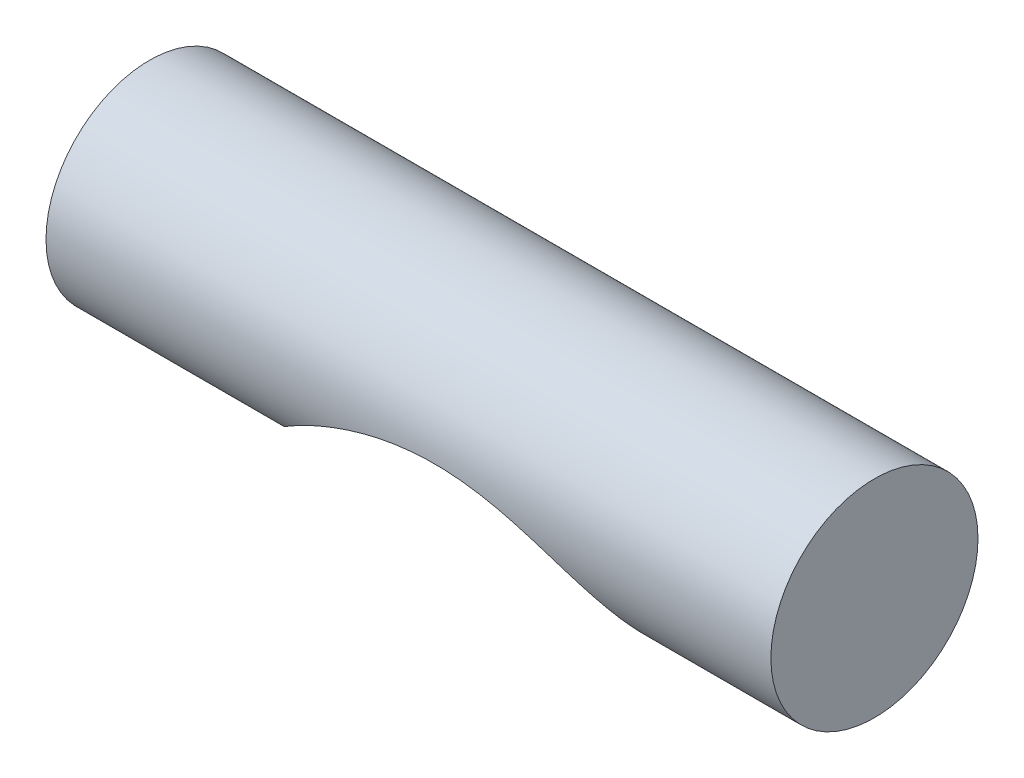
ISO-10303-21;
HEADER;
FILE_DESCRIPTION(('STEP AP214'),'2;1');
FILE_NAME('part.step','',(''),(''),'','','');
FILE_SCHEMA(('AUTOMOTIVE_DESIGN { 1 0 10303 214 1 1 1 1 }'));
ENDSEC;
DATA;
#1=APPLICATION_CONTEXT('core data for automotive mechanical design processes');
#2=APPLICATION_PROTOCOL_DEFINITION('international standard','automotive_design',2000,#1);
#3=PRODUCT_CONTEXT('',#1,'mechanical');
#4=PRODUCT('Part','Part','',(#3));
#5=PRODUCT_RELATED_PRODUCT_CATEGORY('part','',(#4));
#6=PRODUCT_DEFINITION_FORMATION('','',#4);
#7=PRODUCT_DEFINITION_CONTEXT('part definition',#1,'design');
#8=PRODUCT_DEFINITION('design','',#6,#7);
#9=PRODUCT_DEFINITION_SHAPE('','',#8);
#10=(LENGTH_UNIT() NAMED_UNIT(*) SI_UNIT(.MILLI.,.METRE.));
#11=(NAMED_UNIT(*) PLANE_ANGLE_UNIT() SI_UNIT($,.RADIAN.));
#12=(NAMED_UNIT(*) SI_UNIT($,.STERADIAN.) SOLID_ANGLE_UNIT());
#13=UNCERTAINTY_MEASURE_WITH_UNIT(LENGTH_MEASURE(1.E-05),#10,'distance_accuracy_value','');
#14=(GEOMETRIC_REPRESENTATION_CONTEXT(3) GLOBAL_UNCERTAINTY_ASSIGNED_CONTEXT((#13)) GLOBAL_UNIT_ASSIGNED_CONTEXT((#10,
#11,#12)) REPRESENTATION_CONTEXT('',''));
#15=CARTESIAN_POINT('',(0.,0.,0.));
#16=DIRECTION('',(0.,0.,1.));
#17=DIRECTION('',(1.,0.,0.));
#18=AXIS2_PLACEMENT_3D('',#15,#16,#17);
#19=CARTESIAN_POINT('',(-12.978154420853,1.5,-1.5));
#20=DIRECTION('',(-1.,0.,0.));
#21=DIRECTION('',(0.,-1.,0.));
#22=AXIS2_PLACEMENT_3D('',#19,#20,#21);
#23=PLANE('',#22);
#24=CARTESIAN_POINT('',(-12.978154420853,0.,0.));
#25=DIRECTION('',(-1.,0.,0.));
#26=DIRECTION('',(0.,0.,1.));
#27=AXIS2_PLACEMENT_3D('',#24,#25,#26);
#28=CIRCLE('',#27,2.);
#29=CARTESIAN_POINT('',(-12.978154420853,0.,2.));
#30=VERTEX_POINT('',#29);
#31=EDGE_CURVE('E8',#30,#30,#28,.F.);
#32=ORIENTED_EDGE('',*,*,#31,.F.);
#33=EDGE_LOOP('',(#32));
#34=FACE_BOUND('',#33,.T.);
#35=ADVANCED_FACE('F10',(#34),#23,.T.);
#36=CARTESIAN_POINT('',(-5.4781544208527,-5.,-2.));
#37=DIRECTION('',(0.,0.,1.));
#38=DIRECTION('',(1.,0.,0.));
#39=AXIS2_PLACEMENT_3D('',#36,#37,#38);
#40=CYLINDRICAL_SURFACE('',#39,5.00000000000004);
#41=CARTESIAN_POINT('',(-9.46526434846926,-1.98288972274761,-0.261052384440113));
#42=CARTESIAN_POINT('',(-9.45658740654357,-1.97142369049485,-0.348145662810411));
#43=CARTESIAN_POINT('',(-9.44353137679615,-1.95424935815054,-0.43404817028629));
#44=CARTESIAN_POINT('',(-9.40835615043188,-1.90898950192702,-0.602961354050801));
#45=CARTESIAN_POINT('',(-9.38605463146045,-1.88068510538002,-0.685875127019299));
#46=CARTESIAN_POINT('',(-9.33167847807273,-1.81373842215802,-0.847501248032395));
#47=CARTESIAN_POINT('',(-9.2993035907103,-1.77478374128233,-0.925982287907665));
#48=CARTESIAN_POINT('',(-9.2237227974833,-1.68726614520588,-1.07757151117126));
#49=CARTESIAN_POINT('',(-9.18007149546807,-1.63833171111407,-1.15024081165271));
#50=CARTESIAN_POINT('',(-9.08045380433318,-1.53170183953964,-1.28920975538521));
#51=CARTESIAN_POINT('',(-9.02386826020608,-1.47364257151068,-1.35478091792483));
#52=CARTESIAN_POINT('',(-8.89628814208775,-1.34966744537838,-1.47876362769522));
#53=CARTESIAN_POINT('',(-8.82447240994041,-1.28350555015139,-1.53607255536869));
#54=CARTESIAN_POINT('',(-8.66334360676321,-1.14420677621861,-1.64296833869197));
#55=CARTESIAN_POINT('',(-8.57297295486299,-1.07111194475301,-1.69098905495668));
#56=CARTESIAN_POINT('',(-8.36966578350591,-0.918635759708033,-1.77903248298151));
#57=CARTESIAN_POINT('',(-8.25535430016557,-0.839867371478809,-1.81690398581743));
#58=CARTESIAN_POINT('',(-8.06569598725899,-0.720781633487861,-1.8662244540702));
#59=CARTESIAN_POINT('',(-7.99313447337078,-0.677724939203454,-1.8821769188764));
#60=CARTESIAN_POINT('',(-7.84531325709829,-0.595034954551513,-1.90993097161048));
#61=CARTESIAN_POINT('',(-7.77005367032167,-0.555401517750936,-1.92173273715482));
#62=CARTESIAN_POINT('',(-7.6035885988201,-0.473121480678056,-1.94378011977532));
#63=CARTESIAN_POINT('',(-7.51193830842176,-0.431203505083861,-1.95337003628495));
#64=CARTESIAN_POINT('',(-7.30534382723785,-0.344188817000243,-1.97076643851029));
#65=CARTESIAN_POINT('',(-7.18975133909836,-0.300457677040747,-1.97770227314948));
#66=CARTESIAN_POINT('',(-6.95744134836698,-0.222292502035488,-1.98799220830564));
#67=CARTESIAN_POINT('',(-6.84077328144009,-0.187717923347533,-1.9914031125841));
#68=CARTESIAN_POINT('',(-6.60513873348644,-0.127145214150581,-1.99618528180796));
#69=CARTESIAN_POINT('',(-6.48617114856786,-0.101151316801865,-1.99755554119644));
#70=CARTESIAN_POINT('',(-6.21993672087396,-0.0530913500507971,-1.99947288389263));
#71=CARTESIAN_POINT('',(-6.07227274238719,-0.0331922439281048,-1.99976840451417));
#72=CARTESIAN_POINT('',(-5.77578608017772,-0.00664801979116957,-2.00003318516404));
#73=CARTESIAN_POINT('',(-5.62696361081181,-5.05713533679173E-07,-2.00000250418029));
#74=CARTESIAN_POINT('',(-5.35648450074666,4.13484786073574E-07,-1.99999795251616));
#75=CARTESIAN_POINT('',(-5.23482338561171,-0.00444278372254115,-2.0000147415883));
#76=CARTESIAN_POINT('',(-4.99214921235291,-0.0221892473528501,-1.99989659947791));
#77=CARTESIAN_POINT('',(-4.87113615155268,-0.0354924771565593,-1.99976166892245));
#78=CARTESIAN_POINT('',(-4.60350949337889,-0.0748457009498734,-1.99871857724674));
#79=CARTESIAN_POINT('',(-4.45721303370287,-0.103078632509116,-1.99764448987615));
#80=CARTESIAN_POINT('',(-4.16781459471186,-0.172461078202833,-1.99285395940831));
#81=CARTESIAN_POINT('',(-4.02471104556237,-0.213604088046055,-1.9891388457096));
#82=CARTESIAN_POINT('',(-3.78797867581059,-0.293245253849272,-1.97864979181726));
#83=CARTESIAN_POINT('',(-3.69315057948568,-0.328388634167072,-1.97323236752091));
#84=CARTESIAN_POINT('',(-3.48524888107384,-0.412674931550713,-1.95753089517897));
#85=CARTESIAN_POINT('',(-3.37279072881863,-0.463194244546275,-1.94643423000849));
#86=CARTESIAN_POINT('',(-3.10988443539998,-0.593159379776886,-1.91162356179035));
#87=CARTESIAN_POINT('',(-2.96158383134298,-0.676232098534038,-1.88468801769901));
#88=CARTESIAN_POINT('',(-2.70090921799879,-0.839885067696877,-1.81688582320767));
#89=CARTESIAN_POINT('',(-2.58663172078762,-0.918640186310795,-1.77902793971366));
#90=CARTESIAN_POINT('',(-2.38334579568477,-1.07110807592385,-1.69099302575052));
#91=CARTESIAN_POINT('',(-2.29296775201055,-1.14420579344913,-1.64296934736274));
#92=CARTESIAN_POINT('',(-2.13183416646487,-1.2835064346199,-1.53607164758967));
#93=CARTESIAN_POINT('',(-2.06002011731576,-1.34966767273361,-1.47876339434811));
#94=CARTESIAN_POINT('',(-1.93244111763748,-1.47364236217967,-1.35478113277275));
#95=CARTESIAN_POINT('',(-1.87585517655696,-1.53170178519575,-1.28920981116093));
#96=CARTESIAN_POINT('',(-1.77623721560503,-1.63833176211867,-1.15024075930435));
#97=CARTESIAN_POINT('',(-1.73258601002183,-1.68726615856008,-1.07757149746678));
#98=CARTESIAN_POINT('',(-1.65700528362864,-1.77478372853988,-0.925982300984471));
#99=CARTESIAN_POINT('',(-1.62463037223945,-1.81373841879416,-0.847501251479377));
#100=CARTESIAN_POINT('',(-1.57025420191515,-1.88068510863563,-0.685875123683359));
#101=CARTESIAN_POINT('',(-1.54795268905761,-1.90898950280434,-0.602961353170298));
#102=CARTESIAN_POINT('',(-1.51277746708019,-1.95424935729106,-0.434048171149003));
#103=CARTESIAN_POINT('',(-1.49972143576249,-1.97142369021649,-0.34814566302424));
#104=CARTESIAN_POINT('',(-1.48245265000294,-1.99424330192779,-0.174813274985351));
#105=CARTESIAN_POINT('',(-1.47815442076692,-2.00000000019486,-0.0874066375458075));
#106=CARTESIAN_POINT('',(-1.47815442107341,-2.00000000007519,0.0874066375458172));
#107=CARTESIAN_POINT('',(-1.48245265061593,-1.99424330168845,0.174813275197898));
#108=CARTESIAN_POINT('',(-1.49972143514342,-1.97142369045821,0.348145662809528));
#109=CARTESIAN_POINT('',(-1.51277746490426,-1.95424935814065,0.434048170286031));
#110=CARTESIAN_POINT('',(-1.54795269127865,-1.90898950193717,0.602961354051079));
#111=CARTESIAN_POINT('',(-1.57025421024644,-1.88068510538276,0.685875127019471));
#112=CARTESIAN_POINT('',(-1.62463036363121,-1.81373842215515,0.847501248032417));
#113=CARTESIAN_POINT('',(-1.65700525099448,-1.77478374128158,0.925982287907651));
#114=CARTESIAN_POINT('',(-1.73258604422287,-1.6872661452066,1.07757151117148));
#115=CARTESIAN_POINT('',(-1.77623734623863,-1.638331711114,1.15024081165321));
#116=CARTESIAN_POINT('',(-1.87585503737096,-1.53170183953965,1.28920975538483));
#117=CARTESIAN_POINT('',(-1.93244058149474,-1.47364257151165,1.35478091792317));
#118=CARTESIAN_POINT('',(-2.06002069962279,-1.34966744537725,1.47876362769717));
#119=CARTESIAN_POINT('',(-2.13183643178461,-1.28350555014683,1.53607255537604));
#120=CARTESIAN_POINT('',(-2.29296523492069,-1.14420677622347,1.642968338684));
#121=CARTESIAN_POINT('',(-2.38333588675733,-1.07111194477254,1.69098905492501));
#122=CARTESIAN_POINT('',(-2.58664305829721,-0.918635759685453,1.77903248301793));
#123=CARTESIAN_POINT('',(-2.70095454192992,-0.839867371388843,1.81690398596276));
#124=CARTESIAN_POINT('',(-2.89061285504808,-0.720781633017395,1.86622445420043));
#125=CARTESIAN_POINT('',(-2.96317436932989,-0.677724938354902,1.88217691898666));
#126=CARTESIAN_POINT('',(-3.11099558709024,-0.595034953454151,1.90993097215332));
#127=CARTESIAN_POINT('',(-3.18625517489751,-0.555401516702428,1.92173273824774));
#128=CARTESIAN_POINT('',(-3.35272023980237,-0.473121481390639,1.94378011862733));
#129=CARTESIAN_POINT('',(-3.44437052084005,-0.431203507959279,1.95337003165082));
#130=CARTESIAN_POINT('',(-3.651014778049,-0.344167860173,1.97077063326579));
#131=CARTESIAN_POINT('',(-3.766658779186,-0.300419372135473,1.97770836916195));
#132=CARTESIAN_POINT('',(-3.99899237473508,-0.222254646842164,1.98799615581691));
#133=CARTESIAN_POINT('',(-4.11563043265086,-0.187691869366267,1.99140542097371));
#134=CARTESIAN_POINT('',(-4.35120362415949,-0.127138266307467,1.99618557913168));
#135=CARTESIAN_POINT('',(-4.47013986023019,-0.101151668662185,1.99755546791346));
#136=CARTESIAN_POINT('',(-4.73634728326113,-0.0530949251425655,1.99947281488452));
#137=CARTESIAN_POINT('',(-4.88401612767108,-0.0331944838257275,1.9997683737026));
#138=CARTESIAN_POINT('',(-5.18051268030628,-0.0066484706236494,2.00003318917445));
#139=CARTESIAN_POINT('',(-5.32934017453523,-5.06770461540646E-07,2.00000250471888));
#140=CARTESIAN_POINT('',(-5.59982442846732,4.14335382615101E-07,1.99999795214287));
#141=CARTESIAN_POINT('',(-5.72148566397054,-0.00444279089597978,2.00001474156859));
#142=CARTESIAN_POINT('',(-5.96416007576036,-0.0221892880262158,1.99989659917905));
#143=CARTESIAN_POINT('',(-6.0851732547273,-0.0354925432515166,1.9997616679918));
#144=CARTESIAN_POINT('',(-6.35280113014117,-0.0748459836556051,1.99871856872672));
#145=CARTESIAN_POINT('',(-6.49909867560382,-0.103079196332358,1.99764446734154));
#146=CARTESIAN_POINT('',(-6.78849923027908,-0.172462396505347,1.99285385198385));
#147=CARTESIAN_POINT('',(-6.93160380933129,-0.213605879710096,1.98913866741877));
#148=CARTESIAN_POINT('',(-7.16833477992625,-0.29324696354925,1.97864952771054));
#149=CARTESIAN_POINT('',(-7.26316053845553,-0.328389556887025,1.97323219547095));
#150=CARTESIAN_POINT('',(-7.47105995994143,-0.412674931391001,1.95753089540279));
#151=CARTESIAN_POINT('',(-7.58351811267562,-0.463194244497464,1.94643423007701));
#152=CARTESIAN_POINT('',(-7.84642440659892,-0.593159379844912,1.91162356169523));
#153=CARTESIAN_POINT('',(-7.99472501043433,-0.676232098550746,1.88468801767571));
#154=CARTESIAN_POINT('',(-8.25539962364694,-0.83988506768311,1.816885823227));
#155=CARTESIAN_POINT('',(-8.36967712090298,-0.918640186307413,1.77902793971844));
#156=CARTESIAN_POINT('',(-8.57296304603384,-1.07110807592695,1.69099302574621));
#157=CARTESIAN_POINT('',(-8.66334108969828,-1.14420579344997,1.64296934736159));
#158=CARTESIAN_POINT('',(-8.82447467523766,-1.28350643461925,1.53607164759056));
#159=CARTESIAN_POINT('',(-8.89628872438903,-1.34966767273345,1.47876339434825));
#160=CARTESIAN_POINT('',(-9.02386772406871,-1.47364236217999,1.3547811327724));
#161=CARTESIAN_POINT('',(-9.0804536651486,-1.53170178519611,1.28920981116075));
#162=CARTESIAN_POINT('',(-9.18007162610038,-1.63833176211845,1.1502407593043));
#163=CARTESIAN_POINT('',(-9.22372283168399,-1.68726615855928,1.07757149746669));
#164=CARTESIAN_POINT('',(-9.29930355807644,-1.77478372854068,0.925982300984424));
#165=CARTESIAN_POINT('',(-9.33167846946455,-1.81373841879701,0.847501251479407));
#166=CARTESIAN_POINT('',(-9.38605463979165,-1.88068510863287,0.685875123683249));
#167=CARTESIAN_POINT('',(-9.40835615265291,-1.90898950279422,0.602961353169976));
#168=CARTESIAN_POINT('',(-9.44353137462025,-1.954249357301,0.434048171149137));
#169=CARTESIAN_POINT('',(-9.45658740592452,-1.97142369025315,0.348145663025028));
#170=CARTESIAN_POINT('',(-9.47385619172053,-1.99424330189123,0.174813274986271));
#171=CARTESIAN_POINT('',(-9.478154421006,-2.00000000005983,0.087406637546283));
#172=CARTESIAN_POINT('',(-9.47815442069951,-1.99999999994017,-0.0874066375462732));
#173=CARTESIAN_POINT('',(-9.47385619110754,-1.99424330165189,-0.174813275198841));
#174=CARTESIAN_POINT('',(-9.46526434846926,-1.98288972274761,-0.261052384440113));
#175=B_SPLINE_CURVE_WITH_KNOTS('',3,(#41,#42,#43,#44,#45,#46,#47,#48,#49,#50,#51,#52,#53,#54,
#55,#56,#57,#58,#59,#60,#61,#62,#63,#64,#65,#66,#67,#68,#69,#70,#71,#72,#73,#74,#75,#76,#77,#78,
#79,#80,#81,#82,#83,#84,#85,#86,#87,#88,#89,#90,#91,#92,#93,#94,#95,#96,#97,#98,#99,#100,#101,
#102,#103,#104,#105,#106,#107,#108,#109,#110,#111,#112,#113,#114,#115,#116,#117,#118,#119,#120,
#121,#122,#123,#124,#125,#126,#127,#128,#129,#130,#131,#132,#133,#134,#135,#136,#137,#138,#139,
#140,#141,#142,#143,#144,#145,#146,#147,#148,#149,#150,#151,#152,#153,#154,#155,#156,#157,#158,
#159,#160,#161,#162,#163,#164,#165,#166,#167,#168,#169,#170,#171,#172,#173,#174),.UNSPECIFIED.,
.T.,.F.,(4,2,2,2,2,2,2,2,2,2,2,2,2,2,2,2,2,2,2,2,2,2,2,2,2,2,2,2,2,2,2,2,2,2,2,2,2,2,2,2,2,2,2,
2,2,2,2,2,2,2,2,2,2,2,2,2,2,2,2,2,2,2,2,2,2,2,4),(0.,0.264524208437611,0.534533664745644,
0.813519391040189,1.1059000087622,1.41742233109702,1.75576814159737,2.13171808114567,
2.56186918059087,2.81929543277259,3.07671066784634,3.380159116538,3.75107854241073,
4.11592276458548,4.48094670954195,4.9273335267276,5.37363962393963,5.73855125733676,
6.10346138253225,6.54985178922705,6.99601765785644,7.29963508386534,7.67055930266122,
8.18508348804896,8.61523458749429,8.99118452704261,9.32953033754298,9.64105265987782,
9.93343327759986,10.2124190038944,10.4824284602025,10.7469526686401,11.0088825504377,
11.2708124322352,11.5353366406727,11.8053460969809,12.0843318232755,12.3767124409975,
12.6882347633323,13.0265805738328,13.402530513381,13.8326816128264,14.0901078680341,
14.3475231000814,14.6509715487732,15.0220533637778,15.3868014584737,15.751729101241,
16.1981308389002,16.644451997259,17.0093639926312,17.3742744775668,17.8206682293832,
18.2668374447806,18.5704474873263,18.9413717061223,19.45589589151,19.8860469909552,
20.2619969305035,20.6003427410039,20.9118650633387,21.2042456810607,21.4832314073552,
21.7532408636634,22.0177650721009,22.2796949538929,22.5416248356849),.UNSPECIFIED.);
#176=CARTESIAN_POINT('',(-9.46526434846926,-1.98288972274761,-0.261052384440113));
#177=VERTEX_POINT('',#176);
#178=EDGE_CURVE('E22',#177,#177,#175,.T.);
#179=ORIENTED_EDGE('',*,*,#178,.T.);
#180=EDGE_LOOP('',(#179));
#181=FACE_BOUND('',#180,.T.);
#182=ADVANCED_FACE('F38',(#181),#40,.F.);
#183=CARTESIAN_POINT('',(1.0218455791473,0.,0.));
#184=DIRECTION('',(-1.,0.,0.));
#185=DIRECTION('',(0.,0.,1.));
#186=AXIS2_PLACEMENT_3D('',#183,#184,#185);
#187=CYLINDRICAL_SURFACE('',#186,2.);
#188=ORIENTED_EDGE('',*,*,#178,.F.);
#189=EDGE_LOOP('',(#188));
#190=FACE_BOUND('',#189,.T.);
#191=CARTESIAN_POINT('',(1.0218455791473,0.,0.));
#192=DIRECTION('',(-1.,0.,0.));
#193=DIRECTION('',(0.,0.,1.));
#194=AXIS2_PLACEMENT_3D('',#191,#192,#193);
#195=CIRCLE('',#194,2.);
#196=CARTESIAN_POINT('',(1.0218455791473,0.,2.));
#197=VERTEX_POINT('',#196);
#198=EDGE_CURVE('E17',#197,#197,#195,.F.);
#199=ORIENTED_EDGE('',*,*,#198,.F.);
#200=EDGE_LOOP('',(#199));
#201=FACE_BOUND('',#200,.T.);
#202=ORIENTED_EDGE('',*,*,#31,.T.);
#203=EDGE_LOOP('',(#202));
#204=FACE_BOUND('',#203,.T.);
#205=ADVANCED_FACE('F36',(#190,#201,#204),#187,.T.);
#206=CARTESIAN_POINT('',(1.0218455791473,2.83155948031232,2.40866836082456));
#207=DIRECTION('',(1.,0.,0.));
#208=DIRECTION('',(0.,-1.,0.));
#209=AXIS2_PLACEMENT_3D('',#206,#207,#208);
#210=PLANE('',#209);
#211=ORIENTED_EDGE('',*,*,#198,.T.);
#212=EDGE_LOOP('',(#211));
#213=FACE_BOUND('',#212,.T.);
#214=ADVANCED_FACE('F12',(#213),#210,.T.);
#215=CLOSED_SHELL('',(#35,#182,#205,#214));
#216=MANIFOLD_SOLID_BREP('B1',#215);
#217=ADVANCED_BREP_SHAPE_REPRESENTATION('',(#18,#216),#14);
#218=SHAPE_DEFINITION_REPRESENTATION(#9,#217);
ENDSEC;
END-ISO-10303-21;
